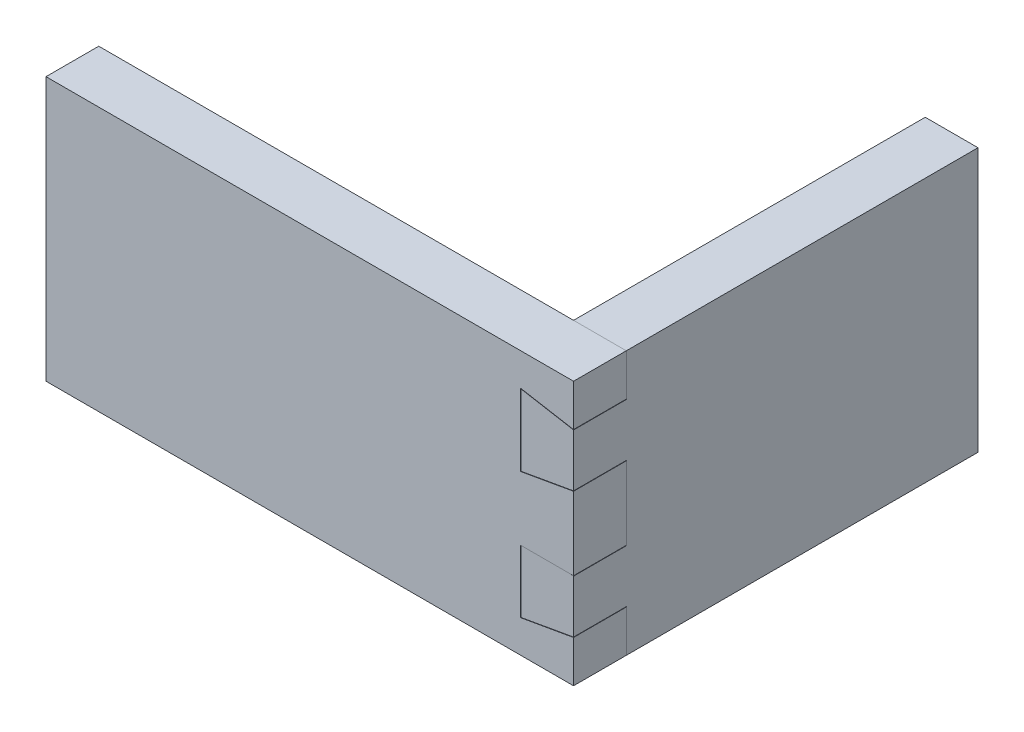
ISO-10303-21;
HEADER;
FILE_DESCRIPTION(('STEP AP214'),'2;1');
FILE_NAME('part.step','',(''),(''),'','','');
FILE_SCHEMA(('AUTOMOTIVE_DESIGN { 1 0 10303 214 1 1 1 1 }'));
ENDSEC;
DATA;
#1=APPLICATION_CONTEXT('core data for automotive mechanical design processes');
#2=APPLICATION_PROTOCOL_DEFINITION('international standard','automotive_design',2000,#1);
#3=PRODUCT_CONTEXT('',#1,'mechanical');
#4=PRODUCT('Part','Part','',(#3));
#5=PRODUCT_RELATED_PRODUCT_CATEGORY('part','',(#4));
#6=PRODUCT_DEFINITION_FORMATION('','',#4);
#7=PRODUCT_DEFINITION_CONTEXT('part definition',#1,'design');
#8=PRODUCT_DEFINITION('design','',#6,#7);
#9=PRODUCT_DEFINITION_SHAPE('','',#8);
#10=(LENGTH_UNIT() NAMED_UNIT(*) SI_UNIT(.MILLI.,.METRE.));
#11=(NAMED_UNIT(*) PLANE_ANGLE_UNIT() SI_UNIT($,.RADIAN.));
#12=(NAMED_UNIT(*) SI_UNIT($,.STERADIAN.) SOLID_ANGLE_UNIT());
#13=UNCERTAINTY_MEASURE_WITH_UNIT(LENGTH_MEASURE(1.E-05),#10,'distance_accuracy_value','');
#14=(GEOMETRIC_REPRESENTATION_CONTEXT(3) GLOBAL_UNCERTAINTY_ASSIGNED_CONTEXT((#13)) GLOBAL_UNIT_ASSIGNED_CONTEXT((#10,
#11,#12)) REPRESENTATION_CONTEXT('',''));
#15=CARTESIAN_POINT('',(0.,0.,0.));
#16=DIRECTION('',(0.,0.,1.));
#17=DIRECTION('',(1.,0.,0.));
#18=AXIS2_PLACEMENT_3D('',#15,#16,#17);
#19=CARTESIAN_POINT('',(0.,176.118742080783,-15.));
#20=DIRECTION('',(0.,0.,-1.));
#21=DIRECTION('',(-1.,0.,0.));
#22=AXIS2_PLACEMENT_3D('',#19,#20,#21);
#23=PLANE('',#22);
#24=DIRECTION('',(0.984807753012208,-0.173648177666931,0.));
#25=VECTOR('',#24,1.);
#26=CARTESIAN_POINT('',(-20.9777533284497,57.1479910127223,-15.));
#27=LINE('',#26,#25);
#28=CARTESIAN_POINT('',(150.,27.,-15.));
#29=VERTEX_POINT('',#28);
#30=CARTESIAN_POINT('',(135.,29.6449047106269,-15.));
#31=VERTEX_POINT('',#30);
#32=EDGE_CURVE('E196',#29,#31,#27,.F.);
#33=ORIENTED_EDGE('',*,*,#32,.F.);
#34=DIRECTION('',(0.,-1.,0.));
#35=VECTOR('',#34,1.);
#36=CARTESIAN_POINT('',(150.,176.118742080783,-15.));
#37=LINE('',#36,#35);
#38=CARTESIAN_POINT('',(150.,48.,-15.));
#39=VERTEX_POINT('',#38);
#40=EDGE_CURVE('E177',#39,#29,#37,.T.);
#41=ORIENTED_EDGE('',*,*,#40,.F.);
#42=DIRECTION('',(-0.984807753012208,-0.173648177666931,0.));
#43=VECTOR('',#42,1.);
#44=CARTESIAN_POINT('',(26.4326487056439,26.2117420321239,-15.));
#45=LINE('',#44,#43);
#46=CARTESIAN_POINT('',(135.,45.355095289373,-15.));
#47=VERTEX_POINT('',#46);
#48=EDGE_CURVE('E128',#47,#39,#45,.F.);
#49=ORIENTED_EDGE('',*,*,#48,.F.);
#50=DIRECTION('',(0.,-1.,0.));
#51=VECTOR('',#50,1.);
#52=CARTESIAN_POINT('',(135.,176.118742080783,-15.));
#53=LINE('',#52,#51);
#54=EDGE_CURVE('E327',#47,#31,#53,.T.);
#55=ORIENTED_EDGE('',*,*,#54,.T.);
#56=EDGE_LOOP('',(#33,#41,#49,#55));
#57=FACE_BOUND('',#56,.T.);
#58=ADVANCED_FACE('F78',(#57),#23,.F.);
#59=DIRECTION('',(-0.984807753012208,-0.173648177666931,0.));
#60=VECTOR('',#59,1.);
#61=CARTESIAN_POINT('',(32.589011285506,-8.70272514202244,-15.));
#62=LINE('',#61,#60);
#63=CARTESIAN_POINT('',(135.,9.35509528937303,-15.));
#64=VERTEX_POINT('',#63);
#65=CARTESIAN_POINT('',(150.,12.,-15.));
#66=VERTEX_POINT('',#65);
#67=EDGE_CURVE('E97',#64,#66,#62,.F.);
#68=ORIENTED_EDGE('',*,*,#67,.F.);
#69=CARTESIAN_POINT('',(135.,0.,-15.));
#70=VERTEX_POINT('',#69);
#71=EDGE_CURVE('E251',#64,#70,#53,.T.);
#72=ORIENTED_EDGE('',*,*,#71,.T.);
#73=DIRECTION('',(1.,0.,0.));
#74=VECTOR('',#73,1.);
#75=CARTESIAN_POINT('',(0.,0.,-15.));
#76=LINE('',#75,#74);
#77=CARTESIAN_POINT('',(150.,0.,-15.));
#78=VERTEX_POINT('',#77);
#79=EDGE_CURVE('E14',#70,#78,#76,.T.);
#80=ORIENTED_EDGE('',*,*,#79,.T.);
#81=EDGE_CURVE('E170',#66,#78,#37,.T.);
#82=ORIENTED_EDGE('',*,*,#81,.F.);
#83=EDGE_LOOP('',(#68,#72,#80,#82));
#84=FACE_BOUND('',#83,.T.);
#85=ADVANCED_FACE('F172',(#84),#23,.F.);
#86=DIRECTION('',(0.984807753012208,-0.173648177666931,0.));
#87=VECTOR('',#86,1.);
#88=CARTESIAN_POINT('',(-14.8213907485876,92.0624581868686,-15.));
#89=LINE('',#88,#87);
#90=CARTESIAN_POINT('',(150.,63.,-15.));
#91=VERTEX_POINT('',#90);
#92=CARTESIAN_POINT('',(135.,65.644904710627,-15.));
#93=VERTEX_POINT('',#92);
#94=EDGE_CURVE('E134',#91,#93,#89,.F.);
#95=ORIENTED_EDGE('',*,*,#94,.F.);
#96=CARTESIAN_POINT('',(150.,75.,-15.));
#97=VERTEX_POINT('',#96);
#98=EDGE_CURVE('E180',#97,#91,#37,.T.);
#99=ORIENTED_EDGE('',*,*,#98,.F.);
#100=DIRECTION('',(1.,0.,0.));
#101=VECTOR('',#100,1.);
#102=CARTESIAN_POINT('',(0.,75.,-15.));
#103=LINE('',#102,#101);
#104=CARTESIAN_POINT('',(135.,75.,-15.));
#105=VERTEX_POINT('',#104);
#106=EDGE_CURVE('E220',#105,#97,#103,.T.);
#107=ORIENTED_EDGE('',*,*,#106,.F.);
#108=EDGE_CURVE('E88',#105,#93,#53,.T.);
#109=ORIENTED_EDGE('',*,*,#108,.T.);
#110=EDGE_LOOP('',(#95,#99,#107,#109));
#111=FACE_BOUND('',#110,.T.);
#112=ADVANCED_FACE('F275',(#111),#23,.F.);
#113=CARTESIAN_POINT('',(0.,75.,0.));
#114=DIRECTION('',(0.,1.,0.));
#115=DIRECTION('',(0.,0.,1.));
#116=AXIS2_PLACEMENT_3D('',#113,#114,#115);
#117=PLANE('',#116);
#118=DIRECTION('',(0.,0.,-1.));
#119=VECTOR('',#118,1.);
#120=CARTESIAN_POINT('',(135.,75.,0.));
#121=LINE('',#120,#119);
#122=CARTESIAN_POINT('',(135.,75.,-115.));
#123=VERTEX_POINT('',#122);
#124=EDGE_CURVE('E249',#105,#123,#121,.T.);
#125=ORIENTED_EDGE('',*,*,#124,.F.);
#126=ORIENTED_EDGE('',*,*,#106,.T.);
#127=DIRECTION('',(0.,0.,-1.));
#128=VECTOR('',#127,1.);
#129=CARTESIAN_POINT('',(150.,75.,0.));
#130=LINE('',#129,#128);
#131=CARTESIAN_POINT('',(150.,75.,-115.));
#132=VERTEX_POINT('',#131);
#133=EDGE_CURVE('E246',#97,#132,#130,.T.);
#134=ORIENTED_EDGE('',*,*,#133,.T.);
#135=DIRECTION('',(1.,0.,0.));
#136=VECTOR('',#135,1.);
#137=CARTESIAN_POINT('',(0.,75.,-115.));
#138=LINE('',#137,#136);
#139=EDGE_CURVE('E258',#123,#132,#138,.T.);
#140=ORIENTED_EDGE('',*,*,#139,.F.);
#141=EDGE_LOOP('',(#125,#126,#134,#140));
#142=FACE_BOUND('',#141,.T.);
#143=ADVANCED_FACE('F273',(#142),#117,.T.);
#144=CARTESIAN_POINT('',(0.,0.,0.));
#145=DIRECTION('',(0.,1.,0.));
#146=DIRECTION('',(0.,0.,1.));
#147=AXIS2_PLACEMENT_3D('',#144,#145,#146);
#148=PLANE('',#147);
#149=ORIENTED_EDGE('',*,*,#79,.F.);
#150=DIRECTION('',(0.,0.,-1.));
#151=VECTOR('',#150,1.);
#152=CARTESIAN_POINT('',(135.,0.,0.));
#153=LINE('',#152,#151);
#154=CARTESIAN_POINT('',(135.,0.,-115.));
#155=VERTEX_POINT('',#154);
#156=EDGE_CURVE('E242',#70,#155,#153,.T.);
#157=ORIENTED_EDGE('',*,*,#156,.T.);
#158=DIRECTION('',(1.,0.,0.));
#159=VECTOR('',#158,1.);
#160=CARTESIAN_POINT('',(0.,0.,-115.));
#161=LINE('',#160,#159);
#162=CARTESIAN_POINT('',(150.,0.,-115.));
#163=VERTEX_POINT('',#162);
#164=EDGE_CURVE('E245',#155,#163,#161,.T.);
#165=ORIENTED_EDGE('',*,*,#164,.T.);
#166=DIRECTION('',(0.,0.,-1.));
#167=VECTOR('',#166,1.);
#168=CARTESIAN_POINT('',(150.,0.,0.));
#169=LINE('',#168,#167);
#170=EDGE_CURVE('E250',#78,#163,#169,.T.);
#171=ORIENTED_EDGE('',*,*,#170,.F.);
#172=EDGE_LOOP('',(#149,#157,#165,#171));
#173=FACE_BOUND('',#172,.T.);
#174=ADVANCED_FACE('F271',(#173),#148,.F.);
#175=CARTESIAN_POINT('',(135.,176.118742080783,0.));
#176=DIRECTION('',(-1.,0.,0.));
#177=DIRECTION('',(0.,0.,1.));
#178=AXIS2_PLACEMENT_3D('',#175,#176,#177);
#179=PLANE('',#178);
#180=ORIENTED_EDGE('',*,*,#108,.F.);
#181=ORIENTED_EDGE('',*,*,#124,.T.);
#182=DIRECTION('',(0.,-1.,0.));
#183=VECTOR('',#182,1.);
#184=CARTESIAN_POINT('',(135.,176.118742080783,-115.));
#185=LINE('',#184,#183);
#186=EDGE_CURVE('E255',#123,#155,#185,.T.);
#187=ORIENTED_EDGE('',*,*,#186,.T.);
#188=ORIENTED_EDGE('',*,*,#156,.F.);
#189=ORIENTED_EDGE('',*,*,#71,.F.);
#190=DIRECTION('',(0.,0.,1.));
#191=VECTOR('',#190,1.);
#192=CARTESIAN_POINT('',(135.,9.35509528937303,0.));
#193=LINE('',#192,#191);
#194=CARTESIAN_POINT('',(135.,9.35509528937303,0.));
#195=VERTEX_POINT('',#194);
#196=EDGE_CURVE('E190',#195,#64,#193,.F.);
#197=ORIENTED_EDGE('',*,*,#196,.F.);
#198=DIRECTION('',(0.,1.,0.));
#199=VECTOR('',#198,1.);
#200=CARTESIAN_POINT('',(135.,27.,0.));
#201=LINE('',#200,#199);
#202=CARTESIAN_POINT('',(135.,29.644904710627,0.));
#203=VERTEX_POINT('',#202);
#204=EDGE_CURVE('E209',#195,#203,#201,.T.);
#205=ORIENTED_EDGE('',*,*,#204,.T.);
#206=DIRECTION('',(0.,0.,1.));
#207=VECTOR('',#206,1.);
#208=CARTESIAN_POINT('',(135.,29.644904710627,15.));
#209=LINE('',#208,#207);
#210=EDGE_CURVE('E206',#203,#31,#209,.F.);
#211=ORIENTED_EDGE('',*,*,#210,.T.);
#212=ORIENTED_EDGE('',*,*,#54,.F.);
#213=DIRECTION('',(0.,0.,1.));
#214=VECTOR('',#213,1.);
#215=CARTESIAN_POINT('',(135.,45.355095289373,0.));
#216=LINE('',#215,#214);
#217=CARTESIAN_POINT('',(135.,45.355095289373,0.));
#218=VERTEX_POINT('',#217);
#219=EDGE_CURVE('E214',#218,#47,#216,.F.);
#220=ORIENTED_EDGE('',*,*,#219,.F.);
#221=DIRECTION('',(0.,1.,0.));
#222=VECTOR('',#221,1.);
#223=CARTESIAN_POINT('',(135.,63.,0.));
#224=LINE('',#223,#222);
#225=CARTESIAN_POINT('',(135.,65.644904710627,0.));
#226=VERTEX_POINT('',#225);
#227=EDGE_CURVE('E221',#218,#226,#224,.T.);
#228=ORIENTED_EDGE('',*,*,#227,.T.);
#229=DIRECTION('',(0.,0.,1.));
#230=VECTOR('',#229,1.);
#231=CARTESIAN_POINT('',(135.,65.644904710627,15.));
#232=LINE('',#231,#230);
#233=EDGE_CURVE('E210',#226,#93,#232,.F.);
#234=ORIENTED_EDGE('',*,*,#233,.T.);
#235=EDGE_LOOP('',(#180,#181,#187,#188,#189,#197,#205,#211,#212,#220,#228,#234));
#236=FACE_BOUND('',#235,.T.);
#237=ADVANCED_FACE('F266',(#236),#179,.T.);
#238=CARTESIAN_POINT('',(0.,176.118742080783,-115.));
#239=DIRECTION('',(0.,0.,-1.));
#240=DIRECTION('',(-1.,0.,0.));
#241=AXIS2_PLACEMENT_3D('',#238,#239,#240);
#242=PLANE('',#241);
#243=ORIENTED_EDGE('',*,*,#186,.F.);
#244=ORIENTED_EDGE('',*,*,#139,.T.);
#245=DIRECTION('',(0.,-1.,0.));
#246=VECTOR('',#245,1.);
#247=CARTESIAN_POINT('',(150.,176.118742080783,-115.));
#248=LINE('',#247,#246);
#249=EDGE_CURVE('E178',#132,#163,#248,.T.);
#250=ORIENTED_EDGE('',*,*,#249,.T.);
#251=ORIENTED_EDGE('',*,*,#164,.F.);
#252=EDGE_LOOP('',(#243,#244,#250,#251));
#253=FACE_BOUND('',#252,.T.);
#254=ADVANCED_FACE('F268',(#253),#242,.T.);
#255=CARTESIAN_POINT('',(150.,176.118742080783,0.));
#256=DIRECTION('',(-1.,0.,0.));
#257=DIRECTION('',(0.,0.,1.));
#258=AXIS2_PLACEMENT_3D('',#255,#256,#257);
#259=PLANE('',#258);
#260=ORIENTED_EDGE('',*,*,#133,.F.);
#261=ORIENTED_EDGE('',*,*,#98,.T.);
#262=DIRECTION('',(0.,0.,-1.));
#263=VECTOR('',#262,1.);
#264=CARTESIAN_POINT('',(150.,63.,15.));
#265=LINE('',#264,#263);
#266=CARTESIAN_POINT('',(150.,63.,0.));
#267=VERTEX_POINT('',#266);
#268=EDGE_CURVE('E226',#267,#91,#265,.T.);
#269=ORIENTED_EDGE('',*,*,#268,.F.);
#270=DIRECTION('',(0.,-1.,0.));
#271=VECTOR('',#270,1.);
#272=CARTESIAN_POINT('',(150.,48.,0.));
#273=LINE('',#272,#271);
#274=CARTESIAN_POINT('',(150.,48.,0.));
#275=VERTEX_POINT('',#274);
#276=EDGE_CURVE('E213',#267,#275,#273,.T.);
#277=ORIENTED_EDGE('',*,*,#276,.T.);
#278=DIRECTION('',(0.,0.,-1.));
#279=VECTOR('',#278,1.);
#280=CARTESIAN_POINT('',(150.,48.,15.));
#281=LINE('',#280,#279);
#282=EDGE_CURVE('E228',#275,#39,#281,.T.);
#283=ORIENTED_EDGE('',*,*,#282,.T.);
#284=ORIENTED_EDGE('',*,*,#40,.T.);
#285=DIRECTION('',(0.,0.,-1.));
#286=VECTOR('',#285,1.);
#287=CARTESIAN_POINT('',(150.,27.,15.));
#288=LINE('',#287,#286);
#289=CARTESIAN_POINT('',(150.,27.,0.));
#290=VERTEX_POINT('',#289);
#291=EDGE_CURVE('E191',#290,#29,#288,.T.);
#292=ORIENTED_EDGE('',*,*,#291,.F.);
#293=DIRECTION('',(0.,-1.,0.));
#294=VECTOR('',#293,1.);
#295=CARTESIAN_POINT('',(150.,12.,0.));
#296=LINE('',#295,#294);
#297=CARTESIAN_POINT('',(150.,12.,0.));
#298=VERTEX_POINT('',#297);
#299=EDGE_CURVE('E187',#290,#298,#296,.T.);
#300=ORIENTED_EDGE('',*,*,#299,.T.);
#301=DIRECTION('',(0.,0.,-1.));
#302=VECTOR('',#301,1.);
#303=CARTESIAN_POINT('',(150.,12.,15.));
#304=LINE('',#303,#302);
#305=EDGE_CURVE('E183',#298,#66,#304,.T.);
#306=ORIENTED_EDGE('',*,*,#305,.T.);
#307=ORIENTED_EDGE('',*,*,#81,.T.);
#308=ORIENTED_EDGE('',*,*,#170,.T.);
#309=ORIENTED_EDGE('',*,*,#249,.F.);
#310=EDGE_LOOP('',(#260,#261,#269,#277,#283,#284,#292,#300,#306,#307,#308,#309));
#311=FACE_BOUND('',#310,.T.);
#312=ADVANCED_FACE('F185',(#311),#259,.F.);
#313=CARTESIAN_POINT('',(150.,48.,15.));
#314=DIRECTION('',(0.173648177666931,-0.984807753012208,0.));
#315=DIRECTION('',(0.984807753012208,0.173648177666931,0.));
#316=AXIS2_PLACEMENT_3D('',#313,#314,#315);
#317=PLANE('',#316);
#318=ORIENTED_EDGE('',*,*,#282,.F.);
#319=DIRECTION('',(0.984807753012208,0.173648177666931,0.));
#320=VECTOR('',#319,1.);
#321=CARTESIAN_POINT('',(150.,48.,0.));
#322=LINE('',#321,#320);
#323=EDGE_CURVE('E82',#275,#218,#322,.F.);
#324=ORIENTED_EDGE('',*,*,#323,.T.);
#325=ORIENTED_EDGE('',*,*,#219,.T.);
#326=ORIENTED_EDGE('',*,*,#48,.T.);
#327=EDGE_LOOP('',(#318,#324,#325,#326));
#328=FACE_BOUND('',#327,.T.);
#329=ADVANCED_FACE('F283',(#328),#317,.T.);
#330=CARTESIAN_POINT('',(150.,63.,15.));
#331=DIRECTION('',(0.173648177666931,0.984807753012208,0.));
#332=DIRECTION('',(-0.984807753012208,0.173648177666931,0.));
#333=AXIS2_PLACEMENT_3D('',#330,#331,#332);
#334=PLANE('',#333);
#335=ORIENTED_EDGE('',*,*,#233,.F.);
#336=DIRECTION('',(-0.984807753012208,0.173648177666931,0.));
#337=VECTOR('',#336,1.);
#338=CARTESIAN_POINT('',(150.,63.,0.));
#339=LINE('',#338,#337);
#340=EDGE_CURVE('E217',#226,#267,#339,.F.);
#341=ORIENTED_EDGE('',*,*,#340,.T.);
#342=ORIENTED_EDGE('',*,*,#268,.T.);
#343=ORIENTED_EDGE('',*,*,#94,.T.);
#344=EDGE_LOOP('',(#335,#341,#342,#343));
#345=FACE_BOUND('',#344,.T.);
#346=ADVANCED_FACE('F80',(#345),#334,.T.);
#347=CARTESIAN_POINT('',(0.,75.,0.));
#348=DIRECTION('',(0.,0.,-1.));
#349=DIRECTION('',(-1.,0.,0.));
#350=AXIS2_PLACEMENT_3D('',#347,#348,#349);
#351=PLANE('',#350);
#352=ORIENTED_EDGE('',*,*,#227,.F.);
#353=ORIENTED_EDGE('',*,*,#323,.F.);
#354=ORIENTED_EDGE('',*,*,#276,.F.);
#355=ORIENTED_EDGE('',*,*,#340,.F.);
#356=EDGE_LOOP('',(#352,#353,#354,#355));
#357=FACE_BOUND('',#356,.T.);
#358=ADVANCED_FACE('F282',(#357),#351,.F.);
#359=CARTESIAN_POINT('',(150.,12.,15.));
#360=DIRECTION('',(0.173648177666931,-0.984807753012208,0.));
#361=DIRECTION('',(0.984807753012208,0.173648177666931,0.));
#362=AXIS2_PLACEMENT_3D('',#359,#360,#361);
#363=PLANE('',#362);
#364=ORIENTED_EDGE('',*,*,#305,.F.);
#365=DIRECTION('',(0.984807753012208,0.173648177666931,0.));
#366=VECTOR('',#365,1.);
#367=CARTESIAN_POINT('',(150.,12.,0.));
#368=LINE('',#367,#366);
#369=EDGE_CURVE('E207',#298,#195,#368,.F.);
#370=ORIENTED_EDGE('',*,*,#369,.T.);
#371=ORIENTED_EDGE('',*,*,#196,.T.);
#372=ORIENTED_EDGE('',*,*,#67,.T.);
#373=EDGE_LOOP('',(#364,#370,#371,#372));
#374=FACE_BOUND('',#373,.T.);
#375=ADVANCED_FACE('F194',(#374),#363,.T.);
#376=CARTESIAN_POINT('',(150.,27.,15.));
#377=DIRECTION('',(0.173648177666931,0.984807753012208,0.));
#378=DIRECTION('',(-0.984807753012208,0.173648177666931,0.));
#379=AXIS2_PLACEMENT_3D('',#376,#377,#378);
#380=PLANE('',#379);
#381=ORIENTED_EDGE('',*,*,#210,.F.);
#382=DIRECTION('',(-0.984807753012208,0.173648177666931,0.));
#383=VECTOR('',#382,1.);
#384=CARTESIAN_POINT('',(150.,27.,0.));
#385=LINE('',#384,#383);
#386=EDGE_CURVE('E216',#203,#290,#385,.F.);
#387=ORIENTED_EDGE('',*,*,#386,.T.);
#388=ORIENTED_EDGE('',*,*,#291,.T.);
#389=ORIENTED_EDGE('',*,*,#32,.T.);
#390=EDGE_LOOP('',(#381,#387,#388,#389));
#391=FACE_BOUND('',#390,.T.);
#392=ADVANCED_FACE('F309',(#391),#380,.T.);
#393=CARTESIAN_POINT('',(0.,75.,0.));
#394=DIRECTION('',(0.,0.,-1.));
#395=DIRECTION('',(-1.,0.,0.));
#396=AXIS2_PLACEMENT_3D('',#393,#394,#395);
#397=PLANE('',#396);
#398=ORIENTED_EDGE('',*,*,#204,.F.);
#399=ORIENTED_EDGE('',*,*,#369,.F.);
#400=ORIENTED_EDGE('',*,*,#299,.F.);
#401=ORIENTED_EDGE('',*,*,#386,.F.);
#402=EDGE_LOOP('',(#398,#399,#400,#401));
#403=FACE_BOUND('',#402,.T.);
#404=ADVANCED_FACE('F314',(#403),#397,.F.);
#405=CLOSED_SHELL('',(#58,#85,#112,#143,#174,#237,#254,#312,#329,#346,#358,#375,#392,#404));
#406=MANIFOLD_SOLID_BREP('B2',#405);
#407=CARTESIAN_POINT('',(0.,75.,0.));
#408=DIRECTION('',(0.,0.,-1.));
#409=DIRECTION('',(-1.,0.,0.));
#410=AXIS2_PLACEMENT_3D('',#407,#408,#409);
#411=PLANE('',#410);
#412=DIRECTION('',(-0.984807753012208,-0.173648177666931,0.));
#413=VECTOR('',#412,1.);
#414=CARTESIAN_POINT('',(150.,11.9,0.));
#415=LINE('',#414,#413);
#416=CARTESIAN_POINT('',(150.,11.9,0.));
#417=VERTEX_POINT('',#416);
#418=CARTESIAN_POINT('',(134.9,9.23746259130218,0.));
#419=VERTEX_POINT('',#418);
#420=EDGE_CURVE('E567',#417,#419,#415,.T.);
#421=ORIENTED_EDGE('',*,*,#420,.T.);
#422=DIRECTION('',(0.,1.,0.));
#423=VECTOR('',#422,1.);
#424=CARTESIAN_POINT('',(134.9,27.1,0.));
#425=LINE('',#424,#423);
#426=CARTESIAN_POINT('',(134.9,27.1,0.));
#427=VERTEX_POINT('',#426);
#428=EDGE_CURVE('E569',#419,#427,#425,.T.);
#429=ORIENTED_EDGE('',*,*,#428,.T.);
#430=DIRECTION('',(1.,0.,0.));
#431=VECTOR('',#430,1.);
#432=CARTESIAN_POINT('',(150.1,27.1,0.));
#433=LINE('',#432,#431);
#434=CARTESIAN_POINT('',(150.,27.1,0.));
#435=VERTEX_POINT('',#434);
#436=EDGE_CURVE('E580',#427,#435,#433,.T.);
#437=ORIENTED_EDGE('',*,*,#436,.T.);
#438=DIRECTION('',(0.,-1.,0.));
#439=VECTOR('',#438,1.);
#440=CARTESIAN_POINT('',(150.,75.,0.));
#441=LINE('',#440,#439);
#442=CARTESIAN_POINT('',(150.,47.9,0.));
#443=VERTEX_POINT('',#442);
#444=EDGE_CURVE('E564',#443,#435,#441,.T.);
#445=ORIENTED_EDGE('',*,*,#444,.F.);
#446=DIRECTION('',(-0.984807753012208,-0.173648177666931,0.));
#447=VECTOR('',#446,1.);
#448=CARTESIAN_POINT('',(150.,47.9,0.));
#449=LINE('',#448,#447);
#450=CARTESIAN_POINT('',(134.9,45.2374625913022,0.));
#451=VERTEX_POINT('',#450);
#452=EDGE_CURVE('E504',#443,#451,#449,.T.);
#453=ORIENTED_EDGE('',*,*,#452,.T.);
#454=DIRECTION('',(0.,1.,0.));
#455=VECTOR('',#454,1.);
#456=CARTESIAN_POINT('',(134.9,63.1,0.));
#457=LINE('',#456,#455);
#458=CARTESIAN_POINT('',(134.9,65.7625374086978,0.));
#459=VERTEX_POINT('',#458);
#460=EDGE_CURVE('E498',#451,#459,#457,.T.);
#461=ORIENTED_EDGE('',*,*,#460,.T.);
#462=DIRECTION('',(0.984807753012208,-0.173648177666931,0.));
#463=VECTOR('',#462,1.);
#464=CARTESIAN_POINT('',(150.,63.1,0.));
#465=LINE('',#464,#463);
#466=CARTESIAN_POINT('',(150.,63.1,0.));
#467=VERTEX_POINT('',#466);
#468=EDGE_CURVE('E429',#459,#467,#465,.T.);
#469=ORIENTED_EDGE('',*,*,#468,.T.);
#470=CARTESIAN_POINT('',(150.,75.,0.));
#471=VERTEX_POINT('',#470);
#472=EDGE_CURVE('E563',#471,#467,#441,.T.);
#473=ORIENTED_EDGE('',*,*,#472,.F.);
#474=DIRECTION('',(1.,0.,0.));
#475=VECTOR('',#474,1.);
#476=CARTESIAN_POINT('',(0.,75.,0.));
#477=LINE('',#476,#475);
#478=CARTESIAN_POINT('',(0.,75.,0.));
#479=VERTEX_POINT('',#478);
#480=EDGE_CURVE('E527',#479,#471,#477,.T.);
#481=ORIENTED_EDGE('',*,*,#480,.F.);
#482=DIRECTION('',(0.,-1.,0.));
#483=VECTOR('',#482,1.);
#484=CARTESIAN_POINT('',(0.,75.,0.));
#485=LINE('',#484,#483);
#486=CARTESIAN_POINT('',(0.,0.,0.));
#487=VERTEX_POINT('',#486);
#488=EDGE_CURVE('E540',#479,#487,#485,.T.);
#489=ORIENTED_EDGE('',*,*,#488,.T.);
#490=DIRECTION('',(1.,0.,0.));
#491=VECTOR('',#490,1.);
#492=CARTESIAN_POINT('',(0.,0.,0.));
#493=LINE('',#492,#491);
#494=CARTESIAN_POINT('',(150.,0.,0.));
#495=VERTEX_POINT('',#494);
#496=EDGE_CURVE('E541',#487,#495,#493,.T.);
#497=ORIENTED_EDGE('',*,*,#496,.T.);
#498=EDGE_CURVE('E561',#417,#495,#441,.T.);
#499=ORIENTED_EDGE('',*,*,#498,.F.);
#500=EDGE_LOOP('',(#421,#429,#437,#445,#453,#461,#469,#473,#481,#489,#497,#499));
#501=FACE_BOUND('',#500,.T.);
#502=ADVANCED_FACE('F425',(#501),#411,.F.);
#503=CARTESIAN_POINT('',(150.,75.,0.));
#504=DIRECTION('',(-1.,0.,0.));
#505=DIRECTION('',(0.,0.,1.));
#506=AXIS2_PLACEMENT_3D('',#503,#504,#505);
#507=PLANE('',#506);
#508=DIRECTION('',(0.,0.,-1.));
#509=VECTOR('',#508,1.);
#510=CARTESIAN_POINT('',(150.,11.9,0.));
#511=LINE('',#510,#509);
#512=CARTESIAN_POINT('',(150.,11.9,-15.));
#513=VERTEX_POINT('',#512);
#514=EDGE_CURVE('E525',#417,#513,#511,.T.);
#515=ORIENTED_EDGE('',*,*,#514,.F.);
#516=ORIENTED_EDGE('',*,*,#498,.T.);
#517=DIRECTION('',(0.,0.,-1.));
#518=VECTOR('',#517,1.);
#519=CARTESIAN_POINT('',(150.,0.,0.));
#520=LINE('',#519,#518);
#521=CARTESIAN_POINT('',(150.,0.,-15.));
#522=VERTEX_POINT('',#521);
#523=EDGE_CURVE('E544',#495,#522,#520,.T.);
#524=ORIENTED_EDGE('',*,*,#523,.T.);
#525=DIRECTION('',(0.,-1.,0.));
#526=VECTOR('',#525,1.);
#527=CARTESIAN_POINT('',(150.,75.,-15.));
#528=LINE('',#527,#526);
#529=EDGE_CURVE('E557',#513,#522,#528,.T.);
#530=ORIENTED_EDGE('',*,*,#529,.F.);
#531=EDGE_LOOP('',(#515,#516,#524,#530));
#532=FACE_BOUND('',#531,.T.);
#533=ADVANCED_FACE('F645',(#532),#507,.F.);
#534=DIRECTION('',(0.,0.,1.));
#535=VECTOR('',#534,1.);
#536=CARTESIAN_POINT('',(150.,27.1,0.));
#537=LINE('',#536,#535);
#538=CARTESIAN_POINT('',(150.,27.1,-15.));
#539=VERTEX_POINT('',#538);
#540=EDGE_CURVE('E519',#539,#435,#537,.T.);
#541=ORIENTED_EDGE('',*,*,#540,.F.);
#542=CARTESIAN_POINT('',(150.,47.9,-15.));
#543=VERTEX_POINT('',#542);
#544=EDGE_CURVE('E562',#543,#539,#528,.T.);
#545=ORIENTED_EDGE('',*,*,#544,.F.);
#546=DIRECTION('',(0.,0.,-1.));
#547=VECTOR('',#546,1.);
#548=CARTESIAN_POINT('',(150.,47.9,0.));
#549=LINE('',#548,#547);
#550=EDGE_CURVE('E526',#443,#543,#549,.T.);
#551=ORIENTED_EDGE('',*,*,#550,.F.);
#552=ORIENTED_EDGE('',*,*,#444,.T.);
#553=EDGE_LOOP('',(#541,#545,#551,#552));
#554=FACE_BOUND('',#553,.T.);
#555=ADVANCED_FACE('F624',(#554),#507,.F.);
#556=DIRECTION('',(0.,0.,1.));
#557=VECTOR('',#556,1.);
#558=CARTESIAN_POINT('',(150.,63.1,0.));
#559=LINE('',#558,#557);
#560=CARTESIAN_POINT('',(150.,63.1,-15.));
#561=VERTEX_POINT('',#560);
#562=EDGE_CURVE('E493',#561,#467,#559,.T.);
#563=ORIENTED_EDGE('',*,*,#562,.F.);
#564=CARTESIAN_POINT('',(150.,75.,-15.));
#565=VERTEX_POINT('',#564);
#566=EDGE_CURVE('E558',#565,#561,#528,.T.);
#567=ORIENTED_EDGE('',*,*,#566,.F.);
#568=DIRECTION('',(0.,0.,-1.));
#569=VECTOR('',#568,1.);
#570=CARTESIAN_POINT('',(150.,75.,0.));
#571=LINE('',#570,#569);
#572=EDGE_CURVE('E530',#471,#565,#571,.T.);
#573=ORIENTED_EDGE('',*,*,#572,.F.);
#574=ORIENTED_EDGE('',*,*,#472,.T.);
#575=EDGE_LOOP('',(#563,#567,#573,#574));
#576=FACE_BOUND('',#575,.T.);
#577=ADVANCED_FACE('F585',(#576),#507,.F.);
#578=CARTESIAN_POINT('',(0.,75.,-15.));
#579=DIRECTION('',(0.,0.,-1.));
#580=DIRECTION('',(-1.,0.,0.));
#581=AXIS2_PLACEMENT_3D('',#578,#579,#580);
#582=PLANE('',#581);
#583=CARTESIAN_POINT('',(134.9,27.1,-15.));
#584=CARTESIAN_POINT('',(134.9,11.9,-15.));
#585=CARTESIAN_POINT('',(134.9,9.05952270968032,-15.));
#586=B_SPLINE_CURVE_WITH_KNOTS('',1,(#583,#584,#585),.UNSPECIFIED.,.F.,.F.,(2,1,2),(0.25,0.5,
0.546718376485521),.UNSPECIFIED.);
#587=CARTESIAN_POINT('',(134.9,27.1,-15.));
#588=VERTEX_POINT('',#587);
#589=CARTESIAN_POINT('',(134.9,9.23746259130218,-15.));
#590=VERTEX_POINT('',#589);
#591=EDGE_CURVE('E444',#588,#590,#586,.T.);
#592=ORIENTED_EDGE('',*,*,#591,.T.);
#593=DIRECTION('',(0.984807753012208,0.173648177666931,0.));
#594=VECTOR('',#593,1.);
#595=CARTESIAN_POINT('',(15.3137889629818,-11.8488129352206,-15.));
#596=LINE('',#595,#594);
#597=EDGE_CURVE('E572',#590,#513,#596,.T.);
#598=ORIENTED_EDGE('',*,*,#597,.T.);
#599=ORIENTED_EDGE('',*,*,#529,.T.);
#600=DIRECTION('',(1.,0.,0.));
#601=VECTOR('',#600,1.);
#602=CARTESIAN_POINT('',(0.,0.,-15.));
#603=LINE('',#602,#601);
#604=CARTESIAN_POINT('',(0.,0.,-15.));
#605=VERTEX_POINT('',#604);
#606=EDGE_CURVE('E547',#605,#522,#603,.T.);
#607=ORIENTED_EDGE('',*,*,#606,.F.);
#608=DIRECTION('',(0.,-1.,0.));
#609=VECTOR('',#608,1.);
#610=CARTESIAN_POINT('',(0.,75.,-15.));
#611=LINE('',#610,#609);
#612=CARTESIAN_POINT('',(0.,75.,-15.));
#613=VERTEX_POINT('',#612);
#614=EDGE_CURVE('E554',#613,#605,#611,.T.);
#615=ORIENTED_EDGE('',*,*,#614,.F.);
#616=DIRECTION('',(1.,0.,0.));
#617=VECTOR('',#616,1.);
#618=CARTESIAN_POINT('',(0.,75.,-15.));
#619=LINE('',#618,#617);
#620=EDGE_CURVE('E534',#613,#565,#619,.T.);
#621=ORIENTED_EDGE('',*,*,#620,.T.);
#622=ORIENTED_EDGE('',*,*,#566,.T.);
#623=DIRECTION('',(-0.984807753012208,0.173648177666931,0.));
#624=VECTOR('',#623,1.);
#625=CARTESIAN_POINT('',(2.48803358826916,89.1103396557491,-15.));
#626=LINE('',#625,#624);
#627=CARTESIAN_POINT('',(134.9,65.7625374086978,-15.));
#628=VERTEX_POINT('',#627);
#629=EDGE_CURVE('E435',#561,#628,#626,.T.);
#630=ORIENTED_EDGE('',*,*,#629,.T.);
#631=CARTESIAN_POINT('',(134.9,65.9404772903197,-15.));
#632=CARTESIAN_POINT('',(134.9,63.1,-15.));
#633=CARTESIAN_POINT('',(134.9,47.9,-15.));
#634=CARTESIAN_POINT('',(134.9,45.0595227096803,-15.));
#635=B_SPLINE_CURVE_WITH_KNOTS('',1,(#631,#632,#633,#634),.UNSPECIFIED.,.F.,.F.,(2,1,1,2),
(0.203281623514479,0.25,0.5,0.546718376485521),.UNSPECIFIED.);
#636=CARTESIAN_POINT('',(134.9,45.2374625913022,-15.));
#637=VERTEX_POINT('',#636);
#638=EDGE_CURVE('E503',#628,#637,#635,.T.);
#639=ORIENTED_EDGE('',*,*,#638,.T.);
#640=DIRECTION('',(0.984807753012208,0.173648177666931,0.));
#641=VECTOR('',#640,1.);
#642=CARTESIAN_POINT('',(9.15742638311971,23.0656542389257,-15.));
#643=LINE('',#642,#641);
#644=EDGE_CURVE('E518',#637,#543,#643,.T.);
#645=ORIENTED_EDGE('',*,*,#644,.T.);
#646=ORIENTED_EDGE('',*,*,#544,.T.);
#647=DIRECTION('',(-1.,0.,0.));
#648=VECTOR('',#647,1.);
#649=CARTESIAN_POINT('',(0.,27.1,-15.));
#650=LINE('',#649,#648);
#651=EDGE_CURVE('E76',#539,#588,#650,.T.);
#652=ORIENTED_EDGE('',*,*,#651,.T.);
#653=EDGE_LOOP('',(#592,#598,#599,#607,#615,#621,#622,#630,#639,#645,#646,#652));
#654=FACE_BOUND('',#653,.T.);
#655=ADVANCED_FACE('F582',(#654),#582,.T.);
#656=CARTESIAN_POINT('',(0.,75.,0.));
#657=DIRECTION('',(-1.,0.,0.));
#658=DIRECTION('',(0.,0.,1.));
#659=AXIS2_PLACEMENT_3D('',#656,#657,#658);
#660=PLANE('',#659);
#661=DIRECTION('',(0.,0.,-1.));
#662=VECTOR('',#661,1.);
#663=CARTESIAN_POINT('',(0.,0.,0.));
#664=LINE('',#663,#662);
#665=EDGE_CURVE('E531',#487,#605,#664,.T.);
#666=ORIENTED_EDGE('',*,*,#665,.F.);
#667=ORIENTED_EDGE('',*,*,#488,.F.);
#668=DIRECTION('',(0.,0.,-1.));
#669=VECTOR('',#668,1.);
#670=CARTESIAN_POINT('',(0.,75.,0.));
#671=LINE('',#670,#669);
#672=EDGE_CURVE('E537',#479,#613,#671,.T.);
#673=ORIENTED_EDGE('',*,*,#672,.T.);
#674=ORIENTED_EDGE('',*,*,#614,.T.);
#675=EDGE_LOOP('',(#666,#667,#673,#674));
#676=FACE_BOUND('',#675,.T.);
#677=ADVANCED_FACE('F609',(#676),#660,.T.);
#678=CARTESIAN_POINT('',(0.,75.,0.));
#679=DIRECTION('',(0.,1.,0.));
#680=DIRECTION('',(0.,0.,1.));
#681=AXIS2_PLACEMENT_3D('',#678,#679,#680);
#682=PLANE('',#681);
#683=ORIENTED_EDGE('',*,*,#480,.T.);
#684=ORIENTED_EDGE('',*,*,#572,.T.);
#685=ORIENTED_EDGE('',*,*,#620,.F.);
#686=ORIENTED_EDGE('',*,*,#672,.F.);
#687=EDGE_LOOP('',(#683,#684,#685,#686));
#688=FACE_BOUND('',#687,.T.);
#689=ADVANCED_FACE('F661',(#688),#682,.T.);
#690=CARTESIAN_POINT('',(0.,0.,0.));
#691=DIRECTION('',(0.,1.,0.));
#692=DIRECTION('',(0.,0.,1.));
#693=AXIS2_PLACEMENT_3D('',#690,#691,#692);
#694=PLANE('',#693);
#695=ORIENTED_EDGE('',*,*,#496,.F.);
#696=ORIENTED_EDGE('',*,*,#665,.T.);
#697=ORIENTED_EDGE('',*,*,#606,.T.);
#698=ORIENTED_EDGE('',*,*,#523,.F.);
#699=EDGE_LOOP('',(#695,#696,#697,#698));
#700=FACE_BOUND('',#699,.T.);
#701=ADVANCED_FACE('F615',(#700),#694,.F.);
#702=CARTESIAN_POINT('',(150.,47.9,0.));
#703=DIRECTION('',(-0.173648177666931,0.984807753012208,0.));
#704=DIRECTION('',(-0.984807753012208,-0.173648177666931,0.));
#705=AXIS2_PLACEMENT_3D('',#702,#703,#704);
#706=PLANE('',#705);
#707=ORIENTED_EDGE('',*,*,#550,.T.);
#708=ORIENTED_EDGE('',*,*,#644,.F.);
#709=DIRECTION('',(0.,0.,-1.));
#710=VECTOR('',#709,1.);
#711=CARTESIAN_POINT('',(134.9,45.2374625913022,0.));
#712=LINE('',#711,#710);
#713=EDGE_CURVE('E505',#451,#637,#712,.T.);
#714=ORIENTED_EDGE('',*,*,#713,.F.);
#715=ORIENTED_EDGE('',*,*,#452,.F.);
#716=EDGE_LOOP('',(#707,#708,#714,#715));
#717=FACE_BOUND('',#716,.T.);
#718=ADVANCED_FACE('F427',(#717),#706,.T.);
#719=CARTESIAN_POINT('',(150.,63.1,0.));
#720=DIRECTION('',(-0.173648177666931,-0.984807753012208,0.));
#721=DIRECTION('',(0.984807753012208,-0.173648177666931,0.));
#722=AXIS2_PLACEMENT_3D('',#719,#720,#721);
#723=PLANE('',#722);
#724=ORIENTED_EDGE('',*,*,#562,.T.);
#725=ORIENTED_EDGE('',*,*,#468,.F.);
#726=DIRECTION('',(0.,0.,-1.));
#727=VECTOR('',#726,1.);
#728=CARTESIAN_POINT('',(134.9,65.7625374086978,15.));
#729=LINE('',#728,#727);
#730=EDGE_CURVE('E490',#459,#628,#729,.T.);
#731=ORIENTED_EDGE('',*,*,#730,.T.);
#732=ORIENTED_EDGE('',*,*,#629,.F.);
#733=EDGE_LOOP('',(#724,#725,#731,#732));
#734=FACE_BOUND('',#733,.T.);
#735=ADVANCED_FACE('F489',(#734),#723,.T.);
#736=CARTESIAN_POINT('',(134.9,63.1,15.));
#737=DIRECTION('',(1.,0.,0.));
#738=DIRECTION('',(0.,0.,-1.));
#739=AXIS2_PLACEMENT_3D('',#736,#737,#738);
#740=PLANE('',#739);
#741=ORIENTED_EDGE('',*,*,#713,.T.);
#742=ORIENTED_EDGE('',*,*,#638,.F.);
#743=ORIENTED_EDGE('',*,*,#730,.F.);
#744=ORIENTED_EDGE('',*,*,#460,.F.);
#745=EDGE_LOOP('',(#741,#742,#743,#744));
#746=FACE_BOUND('',#745,.T.);
#747=ADVANCED_FACE('F500',(#746),#740,.T.);
#748=CARTESIAN_POINT('',(150.,11.9,0.));
#749=DIRECTION('',(-0.173648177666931,0.984807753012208,0.));
#750=DIRECTION('',(-0.984807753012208,-0.173648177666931,0.));
#751=AXIS2_PLACEMENT_3D('',#748,#749,#750);
#752=PLANE('',#751);
#753=ORIENTED_EDGE('',*,*,#514,.T.);
#754=ORIENTED_EDGE('',*,*,#597,.F.);
#755=DIRECTION('',(0.,0.,-1.));
#756=VECTOR('',#755,1.);
#757=CARTESIAN_POINT('',(134.9,9.23746259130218,0.));
#758=LINE('',#757,#756);
#759=EDGE_CURVE('E570',#419,#590,#758,.T.);
#760=ORIENTED_EDGE('',*,*,#759,.F.);
#761=ORIENTED_EDGE('',*,*,#420,.F.);
#762=EDGE_LOOP('',(#753,#754,#760,#761));
#763=FACE_BOUND('',#762,.T.);
#764=ADVANCED_FACE('F644',(#763),#752,.T.);
#765=CARTESIAN_POINT('',(150.1,27.1,15.));
#766=DIRECTION('',(0.,-1.,0.));
#767=DIRECTION('',(0.,0.,-1.));
#768=AXIS2_PLACEMENT_3D('',#765,#766,#767);
#769=PLANE('',#768);
#770=ORIENTED_EDGE('',*,*,#540,.T.);
#771=ORIENTED_EDGE('',*,*,#436,.F.);
#772=DIRECTION('',(0.,0.,-1.));
#773=VECTOR('',#772,1.);
#774=CARTESIAN_POINT('',(134.9,27.1,15.));
#775=LINE('',#774,#773);
#776=EDGE_CURVE('E513',#427,#588,#775,.T.);
#777=ORIENTED_EDGE('',*,*,#776,.T.);
#778=ORIENTED_EDGE('',*,*,#651,.F.);
#779=EDGE_LOOP('',(#770,#771,#777,#778));
#780=FACE_BOUND('',#779,.T.);
#781=ADVANCED_FACE('F639',(#780),#769,.T.);
#782=CARTESIAN_POINT('',(134.9,27.1,15.));
#783=DIRECTION('',(1.,0.,0.));
#784=DIRECTION('',(0.,0.,-1.));
#785=AXIS2_PLACEMENT_3D('',#782,#783,#784);
#786=PLANE('',#785);
#787=ORIENTED_EDGE('',*,*,#759,.T.);
#788=ORIENTED_EDGE('',*,*,#591,.F.);
#789=ORIENTED_EDGE('',*,*,#776,.F.);
#790=ORIENTED_EDGE('',*,*,#428,.F.);
#791=EDGE_LOOP('',(#787,#788,#789,#790));
#792=FACE_BOUND('',#791,.T.);
#793=ADVANCED_FACE('F640',(#792),#786,.T.);
#794=CLOSED_SHELL('',(#502,#533,#555,#577,#655,#677,#689,#701,#718,#735,#747,#764,#781,#793));
#795=MANIFOLD_SOLID_BREP('B8',#794);
#796=ADVANCED_BREP_SHAPE_REPRESENTATION('',(#18,#406,#795),#14);
#797=SHAPE_DEFINITION_REPRESENTATION(#9,#796);
ENDSEC;
END-ISO-10303-21;
